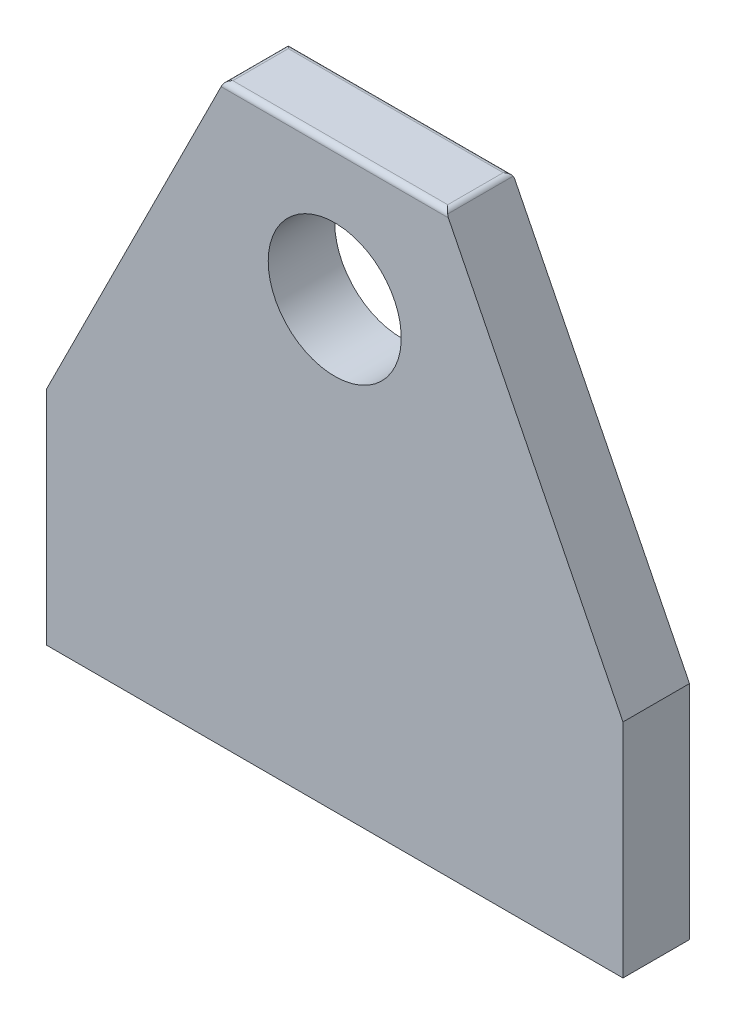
ISO-10303-21;
HEADER;
FILE_DESCRIPTION(('STEP AP214'),'2;1');
FILE_NAME('part.step','',(''),(''),'','','');
FILE_SCHEMA(('AUTOMOTIVE_DESIGN { 1 0 10303 214 1 1 1 1 }'));
ENDSEC;
DATA;
#1=APPLICATION_CONTEXT('core data for automotive mechanical design processes');
#2=APPLICATION_PROTOCOL_DEFINITION('international standard','automotive_design',2000,#1);
#3=PRODUCT_CONTEXT('',#1,'mechanical');
#4=PRODUCT('Part','Part','',(#3));
#5=PRODUCT_RELATED_PRODUCT_CATEGORY('part','',(#4));
#6=PRODUCT_DEFINITION_FORMATION('','',#4);
#7=PRODUCT_DEFINITION_CONTEXT('part definition',#1,'design');
#8=PRODUCT_DEFINITION('design','',#6,#7);
#9=PRODUCT_DEFINITION_SHAPE('','',#8);
#10=(LENGTH_UNIT() NAMED_UNIT(*) SI_UNIT(.MILLI.,.METRE.));
#11=(NAMED_UNIT(*) PLANE_ANGLE_UNIT() SI_UNIT($,.RADIAN.));
#12=(NAMED_UNIT(*) SI_UNIT($,.STERADIAN.) SOLID_ANGLE_UNIT());
#13=UNCERTAINTY_MEASURE_WITH_UNIT(LENGTH_MEASURE(1.E-05),#10,'distance_accuracy_value','');
#14=(GEOMETRIC_REPRESENTATION_CONTEXT(3) GLOBAL_UNCERTAINTY_ASSIGNED_CONTEXT((#13)) GLOBAL_UNIT_ASSIGNED_CONTEXT((#10,
#11,#12)) REPRESENTATION_CONTEXT('',''));
#15=CARTESIAN_POINT('',(0.,0.,0.));
#16=DIRECTION('',(0.,0.,1.));
#17=DIRECTION('',(1.,0.,0.));
#18=AXIS2_PLACEMENT_3D('',#15,#16,#17);
#19=CARTESIAN_POINT('',(41.275,0.,9.525));
#20=DIRECTION('',(0.,0.,-1.));
#21=DIRECTION('',(-1.,0.,0.));
#22=AXIS2_PLACEMENT_3D('',#19,#20,#21);
#23=PLANE('',#22);
#24=DIRECTION('',(0.447213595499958,-0.894427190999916,0.));
#25=VECTOR('',#24,1.);
#26=CARTESIAN_POINT('',(15.875,82.55,9.525));
#27=LINE('',#26,#25);
#28=CARTESIAN_POINT('',(16.271875,81.75625,9.525));
#29=VERTEX_POINT('',#28);
#30=CARTESIAN_POINT('',(41.275,31.75,9.525));
#31=VERTEX_POINT('',#30);
#32=EDGE_CURVE('E113',#29,#31,#27,.T.);
#33=ORIENTED_EDGE('',*,*,#32,.F.);
#34=DIRECTION('',(1.,0.,0.));
#35=VECTOR('',#34,1.);
#36=CARTESIAN_POINT('',(-15.875,81.75625,9.525));
#37=LINE('',#36,#35);
#38=CARTESIAN_POINT('',(-16.271875,81.75625,9.525));
#39=VERTEX_POINT('',#38);
#40=EDGE_CURVE('E171',#29,#39,#37,.F.);
#41=ORIENTED_EDGE('',*,*,#40,.T.);
#42=DIRECTION('',(-0.447213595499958,-0.894427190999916,0.));
#43=VECTOR('',#42,1.);
#44=CARTESIAN_POINT('',(-15.875,82.55,9.525));
#45=LINE('',#44,#43);
#46=CARTESIAN_POINT('',(-41.275,31.75,9.525));
#47=VERTEX_POINT('',#46);
#48=EDGE_CURVE('E146',#39,#47,#45,.T.);
#49=ORIENTED_EDGE('',*,*,#48,.T.);
#50=DIRECTION('',(0.,-1.,0.));
#51=VECTOR('',#50,1.);
#52=CARTESIAN_POINT('',(-41.275,31.75,9.525));
#53=LINE('',#52,#51);
#54=CARTESIAN_POINT('',(-41.275,0.,9.525));
#55=VERTEX_POINT('',#54);
#56=EDGE_CURVE('E144',#47,#55,#53,.T.);
#57=ORIENTED_EDGE('',*,*,#56,.T.);
#58=DIRECTION('',(-1.,0.,0.));
#59=VECTOR('',#58,1.);
#60=CARTESIAN_POINT('',(41.275,0.,9.525));
#61=LINE('',#60,#59);
#62=CARTESIAN_POINT('',(41.275,0.,9.525));
#63=VERTEX_POINT('',#62);
#64=EDGE_CURVE('E142',#63,#55,#61,.T.);
#65=ORIENTED_EDGE('',*,*,#64,.F.);
#66=DIRECTION('',(0.,-1.,0.));
#67=VECTOR('',#66,1.);
#68=CARTESIAN_POINT('',(41.275,31.75,9.525));
#69=LINE('',#68,#67);
#70=EDGE_CURVE('E108',#31,#63,#69,.T.);
#71=ORIENTED_EDGE('',*,*,#70,.F.);
#72=EDGE_LOOP('',(#33,#41,#49,#57,#65,#71));
#73=FACE_BOUND('',#72,.T.);
#74=CARTESIAN_POINT('',(0.,63.5,9.525));
#75=DIRECTION('',(0.,0.,1.));
#76=DIRECTION('',(1.,0.,0.));
#77=AXIS2_PLACEMENT_3D('',#74,#75,#76);
#78=CIRCLE('',#77,9.525);
#79=CARTESIAN_POINT('',(-9.525,63.5,9.525));
#80=VERTEX_POINT('',#79);
#81=EDGE_CURVE('E130',#80,#80,#78,.T.);
#82=ORIENTED_EDGE('',*,*,#81,.F.);
#83=EDGE_LOOP('',(#82));
#84=FACE_BOUND('',#83,.T.);
#85=ADVANCED_FACE('F28',(#73,#84),#23,.F.);
#86=CARTESIAN_POINT('',(41.275,0.,0.));
#87=DIRECTION('',(0.,0.,-1.));
#88=DIRECTION('',(-1.,0.,0.));
#89=AXIS2_PLACEMENT_3D('',#86,#87,#88);
#90=PLANE('',#89);
#91=DIRECTION('',(-0.447213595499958,-0.894427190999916,0.));
#92=VECTOR('',#91,1.);
#93=CARTESIAN_POINT('',(-15.875,82.55,0.));
#94=LINE('',#93,#92);
#95=CARTESIAN_POINT('',(-16.271875,81.75625,0.));
#96=VERTEX_POINT('',#95);
#97=CARTESIAN_POINT('',(-41.275,31.75,0.));
#98=VERTEX_POINT('',#97);
#99=EDGE_CURVE('E138',#96,#98,#94,.T.);
#100=ORIENTED_EDGE('',*,*,#99,.F.);
#101=DIRECTION('',(1.,0.,0.));
#102=VECTOR('',#101,1.);
#103=CARTESIAN_POINT('',(41.275,81.75625,0.));
#104=LINE('',#103,#102);
#105=CARTESIAN_POINT('',(16.271875,81.75625,0.));
#106=VERTEX_POINT('',#105);
#107=EDGE_CURVE('E11',#96,#106,#104,.T.);
#108=ORIENTED_EDGE('',*,*,#107,.T.);
#109=DIRECTION('',(0.447213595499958,-0.894427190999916,0.));
#110=VECTOR('',#109,1.);
#111=CARTESIAN_POINT('',(15.875,82.55,0.));
#112=LINE('',#111,#110);
#113=CARTESIAN_POINT('',(41.275,31.75,0.));
#114=VERTEX_POINT('',#113);
#115=EDGE_CURVE('E128',#106,#114,#112,.T.);
#116=ORIENTED_EDGE('',*,*,#115,.T.);
#117=DIRECTION('',(0.,-1.,0.));
#118=VECTOR('',#117,1.);
#119=CARTESIAN_POINT('',(41.275,31.75,0.));
#120=LINE('',#119,#118);
#121=CARTESIAN_POINT('',(41.275,0.,0.));
#122=VERTEX_POINT('',#121);
#123=EDGE_CURVE('E106',#114,#122,#120,.T.);
#124=ORIENTED_EDGE('',*,*,#123,.T.);
#125=DIRECTION('',(-1.,0.,0.));
#126=VECTOR('',#125,1.);
#127=CARTESIAN_POINT('',(41.275,0.,0.));
#128=LINE('',#127,#126);
#129=CARTESIAN_POINT('',(-41.275,0.,0.));
#130=VERTEX_POINT('',#129);
#131=EDGE_CURVE('E116',#122,#130,#128,.T.);
#132=ORIENTED_EDGE('',*,*,#131,.T.);
#133=DIRECTION('',(0.,-1.,0.));
#134=VECTOR('',#133,1.);
#135=CARTESIAN_POINT('',(-41.275,31.75,0.));
#136=LINE('',#135,#134);
#137=EDGE_CURVE('E122',#98,#130,#136,.T.);
#138=ORIENTED_EDGE('',*,*,#137,.F.);
#139=EDGE_LOOP('',(#100,#108,#116,#124,#132,#138));
#140=FACE_BOUND('',#139,.T.);
#141=CARTESIAN_POINT('',(0.,63.5,0.));
#142=DIRECTION('',(0.,0.,1.));
#143=DIRECTION('',(1.,0.,0.));
#144=AXIS2_PLACEMENT_3D('',#141,#142,#143);
#145=CIRCLE('',#144,9.525);
#146=CARTESIAN_POINT('',(-9.525,63.5,0.));
#147=VERTEX_POINT('',#146);
#148=EDGE_CURVE('E133',#147,#147,#145,.T.);
#149=ORIENTED_EDGE('',*,*,#148,.T.);
#150=EDGE_LOOP('',(#149));
#151=FACE_BOUND('',#150,.T.);
#152=ADVANCED_FACE('F125',(#140,#151),#90,.T.);
#153=CARTESIAN_POINT('',(41.275,31.75,9.525));
#154=DIRECTION('',(1.,0.,0.));
#155=DIRECTION('',(0.,0.,-1.));
#156=AXIS2_PLACEMENT_3D('',#153,#154,#155);
#157=PLANE('',#156);
#158=ORIENTED_EDGE('',*,*,#123,.F.);
#159=DIRECTION('',(0.,0.,-1.));
#160=VECTOR('',#159,1.);
#161=CARTESIAN_POINT('',(41.275,31.75,9.525));
#162=LINE('',#161,#160);
#163=EDGE_CURVE('E149',#31,#114,#162,.T.);
#164=ORIENTED_EDGE('',*,*,#163,.F.);
#165=ORIENTED_EDGE('',*,*,#70,.T.);
#166=DIRECTION('',(0.,0.,-1.));
#167=VECTOR('',#166,1.);
#168=CARTESIAN_POINT('',(41.275,0.,9.525));
#169=LINE('',#168,#167);
#170=EDGE_CURVE('E102',#63,#122,#169,.T.);
#171=ORIENTED_EDGE('',*,*,#170,.T.);
#172=EDGE_LOOP('',(#158,#164,#165,#171));
#173=FACE_BOUND('',#172,.T.);
#174=ADVANCED_FACE('F30',(#173),#157,.T.);
#175=CARTESIAN_POINT('',(15.875,82.55,9.525));
#176=DIRECTION('',(0.894427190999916,0.447213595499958,0.));
#177=DIRECTION('',(-0.447213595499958,0.894427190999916,0.));
#178=AXIS2_PLACEMENT_3D('',#175,#176,#177);
#179=PLANE('',#178);
#180=DIRECTION('',(0.,0.,-1.));
#181=VECTOR('',#180,1.);
#182=CARTESIAN_POINT('',(16.094387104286,82.1112257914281,9.525));
#183=LINE('',#182,#181);
#184=CARTESIAN_POINT('',(16.094387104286,82.1112257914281,0.0837984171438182));
#185=VERTEX_POINT('',#184);
#186=CARTESIAN_POINT('',(16.094387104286,82.1112257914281,9.44120158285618));
#187=VERTEX_POINT('',#186);
#188=EDGE_CURVE('E166',#185,#187,#183,.F.);
#189=ORIENTED_EDGE('',*,*,#188,.T.);
#190=CARTESIAN_POINT('',(16.271875,81.75625,8.73125));
#191=DIRECTION('',(0.894427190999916,0.447213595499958,0.));
#192=DIRECTION('',(-0.447213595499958,0.894427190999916,0.));
#193=AXIS2_PLACEMENT_3D('',#190,#191,#192);
#194=ELLIPSE('',#193,0.887439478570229,0.79375);
#195=EDGE_CURVE('E169',#187,#29,#194,.T.);
#196=ORIENTED_EDGE('',*,*,#195,.T.);
#197=ORIENTED_EDGE('',*,*,#32,.T.);
#198=ORIENTED_EDGE('',*,*,#163,.T.);
#199=ORIENTED_EDGE('',*,*,#115,.F.);
#200=CARTESIAN_POINT('',(16.271875,81.75625,0.79375));
#201=DIRECTION('',(0.894427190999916,0.447213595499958,0.));
#202=DIRECTION('',(0.447213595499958,-0.894427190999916,0.));
#203=AXIS2_PLACEMENT_3D('',#200,#201,#202);
#204=ELLIPSE('',#203,0.887439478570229,0.79375);
#205=EDGE_CURVE('E164',#106,#185,#204,.T.);
#206=ORIENTED_EDGE('',*,*,#205,.T.);
#207=EDGE_LOOP('',(#189,#196,#197,#198,#199,#206));
#208=FACE_BOUND('',#207,.T.);
#209=ADVANCED_FACE('F188',(#208),#179,.T.);
#210=CARTESIAN_POINT('',(-15.875,82.55,9.525));
#211=DIRECTION('',(0.,1.,0.));
#212=DIRECTION('',(0.,0.,1.));
#213=AXIS2_PLACEMENT_3D('',#210,#211,#212);
#214=PLANE('',#213);
#215=DIRECTION('',(1.,0.,0.));
#216=VECTOR('',#215,1.);
#217=CARTESIAN_POINT('',(15.875,82.55,8.73125));
#218=LINE('',#217,#216);
#219=CARTESIAN_POINT('',(-15.3844355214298,82.55,8.73125));
#220=VERTEX_POINT('',#219);
#221=CARTESIAN_POINT('',(15.3844355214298,82.55,8.73125));
#222=VERTEX_POINT('',#221);
#223=EDGE_CURVE('E159',#220,#222,#218,.T.);
#224=ORIENTED_EDGE('',*,*,#223,.T.);
#225=DIRECTION('',(0.,0.,-1.));
#226=VECTOR('',#225,1.);
#227=CARTESIAN_POINT('',(15.3844355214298,82.55,9.525));
#228=LINE('',#227,#226);
#229=CARTESIAN_POINT('',(15.3844355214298,82.55,0.79375));
#230=VERTEX_POINT('',#229);
#231=EDGE_CURVE('E161',#222,#230,#228,.T.);
#232=ORIENTED_EDGE('',*,*,#231,.T.);
#233=DIRECTION('',(1.,0.,0.));
#234=VECTOR('',#233,1.);
#235=CARTESIAN_POINT('',(-15.875,82.55,0.793749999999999));
#236=LINE('',#235,#234);
#237=CARTESIAN_POINT('',(-15.3844355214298,82.55,0.79375));
#238=VERTEX_POINT('',#237);
#239=EDGE_CURVE('E151',#230,#238,#236,.F.);
#240=ORIENTED_EDGE('',*,*,#239,.T.);
#241=DIRECTION('',(0.,0.,-1.));
#242=VECTOR('',#241,1.);
#243=CARTESIAN_POINT('',(-15.3844355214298,82.55,9.525));
#244=LINE('',#243,#242);
#245=EDGE_CURVE('E157',#238,#220,#244,.F.);
#246=ORIENTED_EDGE('',*,*,#245,.T.);
#247=EDGE_LOOP('',(#224,#232,#240,#246));
#248=FACE_BOUND('',#247,.T.);
#249=ADVANCED_FACE('F218',(#248),#214,.T.);
#250=CARTESIAN_POINT('',(-15.875,82.55,9.525));
#251=DIRECTION('',(0.894427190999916,-0.447213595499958,0.));
#252=DIRECTION('',(0.447213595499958,0.894427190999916,0.));
#253=AXIS2_PLACEMENT_3D('',#250,#251,#252);
#254=PLANE('',#253);
#255=ORIENTED_EDGE('',*,*,#48,.F.);
#256=CARTESIAN_POINT('',(-16.271875,81.75625,8.73125));
#257=DIRECTION('',(0.894427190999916,-0.447213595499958,0.));
#258=DIRECTION('',(-0.447213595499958,-0.894427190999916,0.));
#259=AXIS2_PLACEMENT_3D('',#256,#257,#258);
#260=ELLIPSE('',#259,0.887439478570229,0.79375);
#261=CARTESIAN_POINT('',(-16.094387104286,82.1112257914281,9.44120158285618));
#262=VERTEX_POINT('',#261);
#263=EDGE_CURVE('E36',#39,#262,#260,.F.);
#264=ORIENTED_EDGE('',*,*,#263,.T.);
#265=DIRECTION('',(0.,0.,-1.));
#266=VECTOR('',#265,1.);
#267=CARTESIAN_POINT('',(-16.094387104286,82.1112257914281,0.));
#268=LINE('',#267,#266);
#269=CARTESIAN_POINT('',(-16.094387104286,82.1112257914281,0.0837984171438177));
#270=VERTEX_POINT('',#269);
#271=EDGE_CURVE('E46',#262,#270,#268,.T.);
#272=ORIENTED_EDGE('',*,*,#271,.T.);
#273=CARTESIAN_POINT('',(-16.271875,81.75625,0.79375));
#274=DIRECTION('',(0.894427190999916,-0.447213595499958,0.));
#275=DIRECTION('',(0.447213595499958,0.894427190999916,0.));
#276=AXIS2_PLACEMENT_3D('',#273,#274,#275);
#277=ELLIPSE('',#276,0.887439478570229,0.79375);
#278=EDGE_CURVE('E173',#270,#96,#277,.F.);
#279=ORIENTED_EDGE('',*,*,#278,.T.);
#280=ORIENTED_EDGE('',*,*,#99,.T.);
#281=DIRECTION('',(0.,0.,-1.));
#282=VECTOR('',#281,1.);
#283=CARTESIAN_POINT('',(-41.275,31.75,9.525));
#284=LINE('',#283,#282);
#285=EDGE_CURVE('E152',#47,#98,#284,.T.);
#286=ORIENTED_EDGE('',*,*,#285,.F.);
#287=EDGE_LOOP('',(#255,#264,#272,#279,#280,#286));
#288=FACE_BOUND('',#287,.T.);
#289=ADVANCED_FACE('F176',(#288),#254,.F.);
#290=CARTESIAN_POINT('',(-41.275,31.75,9.525));
#291=DIRECTION('',(1.,0.,0.));
#292=DIRECTION('',(0.,0.,-1.));
#293=AXIS2_PLACEMENT_3D('',#290,#291,#292);
#294=PLANE('',#293);
#295=ORIENTED_EDGE('',*,*,#137,.T.);
#296=DIRECTION('',(0.,0.,-1.));
#297=VECTOR('',#296,1.);
#298=CARTESIAN_POINT('',(-41.275,0.,9.525));
#299=LINE('',#298,#297);
#300=EDGE_CURVE('E112',#55,#130,#299,.T.);
#301=ORIENTED_EDGE('',*,*,#300,.F.);
#302=ORIENTED_EDGE('',*,*,#56,.F.);
#303=ORIENTED_EDGE('',*,*,#285,.T.);
#304=EDGE_LOOP('',(#295,#301,#302,#303));
#305=FACE_BOUND('',#304,.T.);
#306=ADVANCED_FACE('F206',(#305),#294,.F.);
#307=CARTESIAN_POINT('',(41.275,0.,9.525));
#308=DIRECTION('',(0.,-1.,0.));
#309=DIRECTION('',(0.,0.,-1.));
#310=AXIS2_PLACEMENT_3D('',#307,#308,#309);
#311=PLANE('',#310);
#312=ORIENTED_EDGE('',*,*,#131,.F.);
#313=ORIENTED_EDGE('',*,*,#170,.F.);
#314=ORIENTED_EDGE('',*,*,#64,.T.);
#315=ORIENTED_EDGE('',*,*,#300,.T.);
#316=EDGE_LOOP('',(#312,#313,#314,#315));
#317=FACE_BOUND('',#316,.T.);
#318=ADVANCED_FACE('F117',(#317),#311,.T.);
#319=CARTESIAN_POINT('',(0.,63.5,9.525));
#320=DIRECTION('',(0.,0.,-1.));
#321=DIRECTION('',(-1.,0.,0.));
#322=AXIS2_PLACEMENT_3D('',#319,#320,#321);
#323=CYLINDRICAL_SURFACE('',#322,9.525);
#324=CARTESIAN_POINT('',(-9.525,63.5,9.525));
#325=CARTESIAN_POINT('',(-9.525,63.5,9.42578125));
#326=CARTESIAN_POINT('',(-9.525,63.5,9.3265625));
#327=CARTESIAN_POINT('',(-9.525,63.5,9.128125));
#328=CARTESIAN_POINT('',(-9.525,63.5,9.02890625));
#329=CARTESIAN_POINT('',(-9.525,63.5,8.83046875));
#330=CARTESIAN_POINT('',(-9.525,63.5,8.73125));
#331=CARTESIAN_POINT('',(-9.525,63.5,8.5328125));
#332=CARTESIAN_POINT('',(-9.525,63.5,8.43359375));
#333=CARTESIAN_POINT('',(-9.525,63.5,8.23515625));
#334=CARTESIAN_POINT('',(-9.525,63.5,8.1359375));
#335=CARTESIAN_POINT('',(-9.525,63.5,7.9375));
#336=CARTESIAN_POINT('',(-9.525,63.5,7.83828125));
#337=CARTESIAN_POINT('',(-9.525,63.5,7.63984375));
#338=CARTESIAN_POINT('',(-9.525,63.5,7.540625));
#339=CARTESIAN_POINT('',(-9.525,63.5,7.3421875));
#340=CARTESIAN_POINT('',(-9.525,63.5,7.24296875));
#341=CARTESIAN_POINT('',(-9.525,63.5,7.04453125));
#342=CARTESIAN_POINT('',(-9.525,63.5,6.9453125));
#343=CARTESIAN_POINT('',(-9.525,63.5,6.746875));
#344=CARTESIAN_POINT('',(-9.525,63.5,6.64765625));
#345=CARTESIAN_POINT('',(-9.525,63.5,6.44921875));
#346=CARTESIAN_POINT('',(-9.525,63.5,6.35));
#347=CARTESIAN_POINT('',(-9.525,63.5,6.1515625));
#348=CARTESIAN_POINT('',(-9.525,63.5,6.05234375));
#349=CARTESIAN_POINT('',(-9.525,63.5,5.85390625));
#350=CARTESIAN_POINT('',(-9.525,63.5,5.7546875));
#351=CARTESIAN_POINT('',(-9.525,63.5,5.55625));
#352=CARTESIAN_POINT('',(-9.525,63.5,5.45703125));
#353=CARTESIAN_POINT('',(-9.525,63.5,5.25859375));
#354=CARTESIAN_POINT('',(-9.525,63.5,5.159375));
#355=CARTESIAN_POINT('',(-9.525,63.5,4.9609375));
#356=CARTESIAN_POINT('',(-9.525,63.5,4.86171875));
#357=CARTESIAN_POINT('',(-9.525,63.5,4.66328125));
#358=CARTESIAN_POINT('',(-9.525,63.5,4.5640625));
#359=CARTESIAN_POINT('',(-9.525,63.5,4.365625));
#360=CARTESIAN_POINT('',(-9.525,63.5,4.26640625));
#361=CARTESIAN_POINT('',(-9.525,63.5,4.06796875));
#362=CARTESIAN_POINT('',(-9.525,63.5,3.96875));
#363=CARTESIAN_POINT('',(-9.525,63.5,3.7703125));
#364=CARTESIAN_POINT('',(-9.525,63.5,3.67109375));
#365=CARTESIAN_POINT('',(-9.525,63.5,3.47265625));
#366=CARTESIAN_POINT('',(-9.525,63.5,3.3734375));
#367=CARTESIAN_POINT('',(-9.525,63.5,3.175));
#368=CARTESIAN_POINT('',(-9.525,63.5,3.07578125));
#369=CARTESIAN_POINT('',(-9.525,63.5,2.87734375));
#370=CARTESIAN_POINT('',(-9.525,63.5,2.778125));
#371=CARTESIAN_POINT('',(-9.525,63.5,2.5796875));
#372=CARTESIAN_POINT('',(-9.525,63.5,2.48046875));
#373=CARTESIAN_POINT('',(-9.525,63.5,2.28203125));
#374=CARTESIAN_POINT('',(-9.525,63.5,2.1828125));
#375=CARTESIAN_POINT('',(-9.525,63.5,1.984375));
#376=CARTESIAN_POINT('',(-9.525,63.5,1.88515625));
#377=CARTESIAN_POINT('',(-9.525,63.5,1.68671875));
#378=CARTESIAN_POINT('',(-9.525,63.5,1.5875));
#379=CARTESIAN_POINT('',(-9.525,63.5,1.3890625));
#380=CARTESIAN_POINT('',(-9.525,63.5,1.28984375));
#381=CARTESIAN_POINT('',(-9.525,63.5,1.09140625));
#382=CARTESIAN_POINT('',(-9.525,63.5,0.992187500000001));
#383=CARTESIAN_POINT('',(-9.525,63.5,0.793750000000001));
#384=CARTESIAN_POINT('',(-9.525,63.5,0.69453125));
#385=CARTESIAN_POINT('',(-9.525,63.5,0.49609375));
#386=CARTESIAN_POINT('',(-9.525,63.5,0.396875));
#387=CARTESIAN_POINT('',(-9.525,63.5,0.1984375));
#388=CARTESIAN_POINT('',(-9.525,63.5,0.0992187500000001));
#389=CARTESIAN_POINT('',(-9.525,63.5,0.));
#390=B_SPLINE_CURVE_WITH_KNOTS('',3,(#324,#325,#326,#327,#328,#329,#330,#331,#332,#333,#334,
#335,#336,#337,#338,#339,#340,#341,#342,#343,#344,#345,#346,#347,#348,#349,#350,#351,#352,#353,
#354,#355,#356,#357,#358,#359,#360,#361,#362,#363,#364,#365,#366,#367,#368,#369,#370,#371,#372,
#373,#374,#375,#376,#377,#378,#379,#380,#381,#382,#383,#384,#385,#386,#387,#388,#389),
.UNSPECIFIED.,.F.,.F.,(4,2,2,2,2,2,2,2,2,2,2,2,2,2,2,2,2,2,2,2,2,2,2,2,2,2,2,2,2,2,2,2,4),(0.,
0.29765625,0.5953125,0.892968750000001,1.190625,1.48828125,1.7859375,2.08359375,2.38125,
2.67890625,2.9765625,3.27421875,3.571875,3.86953125,4.1671875,4.46484375,4.7625,5.06015625,
5.3578125,5.65546875,5.953125,6.25078125,6.5484375,6.84609375,7.14375,7.44140625,7.7390625,
8.03671875,8.334375,8.63203125,8.9296875,9.22734375,9.525),.UNSPECIFIED.);
#391=EDGE_CURVE('BSEAM235',#80,#147,#390,.T.);
#392=ORIENTED_EDGE('',*,*,#81,.T.);
#393=ORIENTED_EDGE('',*,*,#148,.F.);
#394=ORIENTED_EDGE('',*,*,#391,.T.);
#395=ORIENTED_EDGE('',*,*,#391,.F.);
#396=EDGE_LOOP('',(#392,#394,#393,#395));
#397=FACE_BOUND('',#396,.T.);
#398=ADVANCED_FACE('F235',(#397),#323,.F.);
#399=CARTESIAN_POINT('',(-15.3844355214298,81.75625,9.525));
#400=DIRECTION('',(0.,0.,1.));
#401=DIRECTION('',(1.,0.,0.));
#402=AXIS2_PLACEMENT_3D('',#399,#400,#401);
#403=CYLINDRICAL_SURFACE('',#402,0.79375);
#404=CARTESIAN_POINT('',(-15.3844355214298,81.75625,0.79375));
#405=DIRECTION('',(0.707106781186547,0.,-0.707106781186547));
#406=DIRECTION('',(0.707106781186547,0.,0.707106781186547));
#407=AXIS2_PLACEMENT_3D('',#404,#405,#406);
#408=ELLIPSE('',#407,1.12253201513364,0.79375);
#409=EDGE_CURVE('E197',#270,#238,#408,.T.);
#410=ORIENTED_EDGE('',*,*,#409,.F.);
#411=ORIENTED_EDGE('',*,*,#271,.F.);
#412=CARTESIAN_POINT('',(-15.3844355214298,81.75625,8.73125));
#413=DIRECTION('',(0.707106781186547,0.,0.707106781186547));
#414=DIRECTION('',(-0.707106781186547,0.,0.707106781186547));
#415=AXIS2_PLACEMENT_3D('',#412,#413,#414);
#416=ELLIPSE('',#415,1.12253201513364,0.79375);
#417=EDGE_CURVE('E209',#220,#262,#416,.T.);
#418=ORIENTED_EDGE('',*,*,#417,.F.);
#419=ORIENTED_EDGE('',*,*,#245,.F.);
#420=EDGE_LOOP('',(#410,#411,#418,#419));
#421=FACE_BOUND('',#420,.T.);
#422=ADVANCED_FACE('F216',(#421),#403,.T.);
#423=CARTESIAN_POINT('',(-15.875,81.75625,8.73125));
#424=DIRECTION('',(-1.,0.,0.));
#425=DIRECTION('',(0.,0.,1.));
#426=AXIS2_PLACEMENT_3D('',#423,#424,#425);
#427=CYLINDRICAL_SURFACE('',#426,0.79375);
#428=ORIENTED_EDGE('',*,*,#40,.F.);
#429=ORIENTED_EDGE('',*,*,#195,.F.);
#430=CARTESIAN_POINT('',(15.3844355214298,81.75625,8.73125));
#431=DIRECTION('',(-0.707106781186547,0.,0.707106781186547));
#432=DIRECTION('',(-0.707106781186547,0.,-0.707106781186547));
#433=AXIS2_PLACEMENT_3D('',#430,#431,#432);
#434=ELLIPSE('',#433,1.12253201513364,0.79375);
#435=EDGE_CURVE('E193',#222,#187,#434,.F.);
#436=ORIENTED_EDGE('',*,*,#435,.F.);
#437=ORIENTED_EDGE('',*,*,#223,.F.);
#438=ORIENTED_EDGE('',*,*,#417,.T.);
#439=ORIENTED_EDGE('',*,*,#263,.F.);
#440=EDGE_LOOP('',(#428,#429,#436,#437,#438,#439));
#441=FACE_BOUND('',#440,.T.);
#442=ADVANCED_FACE('F200',(#441),#427,.T.);
#443=CARTESIAN_POINT('',(41.275,81.75625,0.79375));
#444=DIRECTION('',(1.,0.,0.));
#445=DIRECTION('',(0.,0.,-1.));
#446=AXIS2_PLACEMENT_3D('',#443,#444,#445);
#447=CYLINDRICAL_SURFACE('',#446,0.79375);
#448=ORIENTED_EDGE('',*,*,#409,.T.);
#449=ORIENTED_EDGE('',*,*,#239,.F.);
#450=CARTESIAN_POINT('',(15.3844355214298,81.75625,0.79375));
#451=DIRECTION('',(0.707106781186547,0.,0.707106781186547));
#452=DIRECTION('',(0.707106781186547,0.,-0.707106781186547));
#453=AXIS2_PLACEMENT_3D('',#450,#451,#452);
#454=ELLIPSE('',#453,1.12253201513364,0.79375);
#455=EDGE_CURVE('E185',#185,#230,#454,.T.);
#456=ORIENTED_EDGE('',*,*,#455,.F.);
#457=ORIENTED_EDGE('',*,*,#205,.F.);
#458=ORIENTED_EDGE('',*,*,#107,.F.);
#459=ORIENTED_EDGE('',*,*,#278,.F.);
#460=EDGE_LOOP('',(#448,#449,#456,#457,#458,#459));
#461=FACE_BOUND('',#460,.T.);
#462=ADVANCED_FACE('F182',(#461),#447,.T.);
#463=CARTESIAN_POINT('',(15.3844355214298,81.75625,9.525));
#464=DIRECTION('',(0.,0.,-1.));
#465=DIRECTION('',(-1.,0.,0.));
#466=AXIS2_PLACEMENT_3D('',#463,#464,#465);
#467=CYLINDRICAL_SURFACE('',#466,0.79375);
#468=ORIENTED_EDGE('',*,*,#435,.T.);
#469=ORIENTED_EDGE('',*,*,#188,.F.);
#470=ORIENTED_EDGE('',*,*,#455,.T.);
#471=ORIENTED_EDGE('',*,*,#231,.F.);
#472=EDGE_LOOP('',(#468,#469,#470,#471));
#473=FACE_BOUND('',#472,.T.);
#474=ADVANCED_FACE('F190',(#473),#467,.T.);
#475=CLOSED_SHELL('',(#85,#152,#174,#209,#249,#289,#306,#318,#398,#422,#442,#462,#474));
#476=MANIFOLD_SOLID_BREP('B2',#475);
#477=ADVANCED_BREP_SHAPE_REPRESENTATION('',(#18,#476),#14);
#478=SHAPE_DEFINITION_REPRESENTATION(#9,#477);
ENDSEC;
END-ISO-10303-21;
